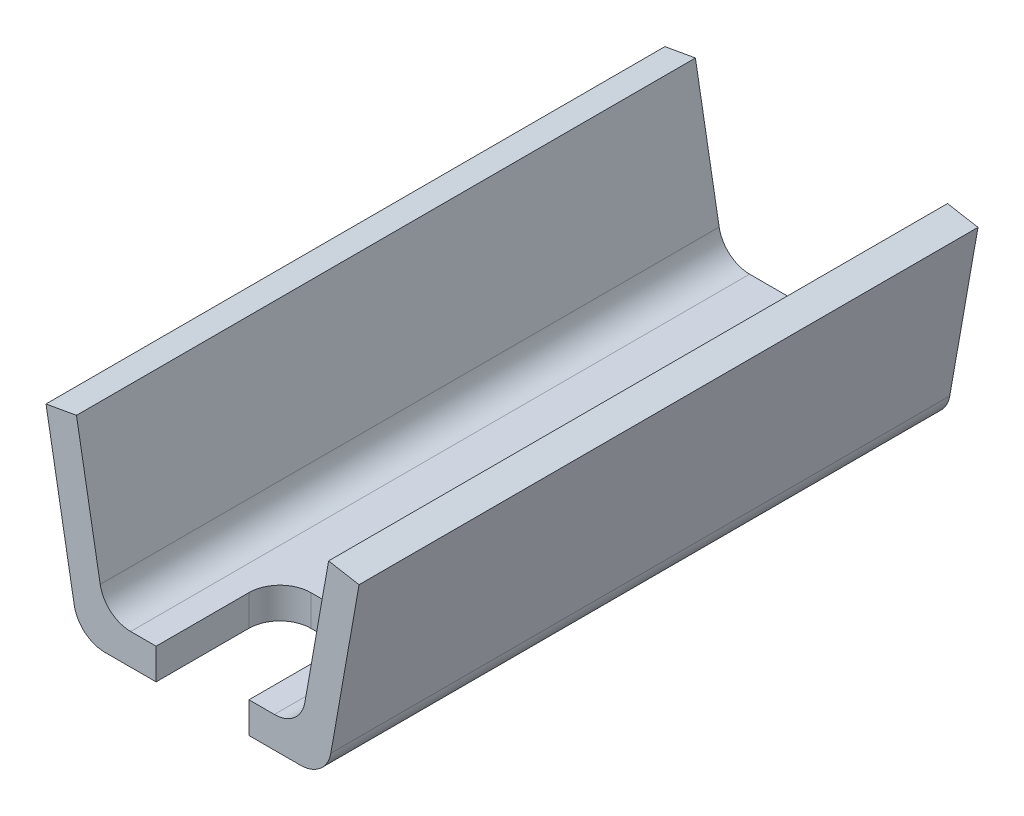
ISO-10303-21;
HEADER;
FILE_DESCRIPTION(('STEP AP214'),'2;1');
FILE_NAME('part.step','',(''),(''),'','','');
FILE_SCHEMA(('AUTOMOTIVE_DESIGN { 1 0 10303 214 1 1 1 1 }'));
ENDSEC;
DATA;
#1=APPLICATION_CONTEXT('core data for automotive mechanical design processes');
#2=APPLICATION_PROTOCOL_DEFINITION('international standard','automotive_design',2000,#1);
#3=PRODUCT_CONTEXT('',#1,'mechanical');
#4=PRODUCT('Part','Part','',(#3));
#5=PRODUCT_RELATED_PRODUCT_CATEGORY('part','',(#4));
#6=PRODUCT_DEFINITION_FORMATION('','',#4);
#7=PRODUCT_DEFINITION_CONTEXT('part definition',#1,'design');
#8=PRODUCT_DEFINITION('design','',#6,#7);
#9=PRODUCT_DEFINITION_SHAPE('','',#8);
#10=(LENGTH_UNIT() NAMED_UNIT(*) SI_UNIT(.MILLI.,.METRE.));
#11=(NAMED_UNIT(*) PLANE_ANGLE_UNIT() SI_UNIT($,.RADIAN.));
#12=(NAMED_UNIT(*) SI_UNIT($,.STERADIAN.) SOLID_ANGLE_UNIT());
#13=UNCERTAINTY_MEASURE_WITH_UNIT(LENGTH_MEASURE(1.E-05),#10,'distance_accuracy_value','');
#14=(GEOMETRIC_REPRESENTATION_CONTEXT(3) GLOBAL_UNCERTAINTY_ASSIGNED_CONTEXT((#13)) GLOBAL_UNIT_ASSIGNED_CONTEXT((#10,
#11,#12)) REPRESENTATION_CONTEXT('',''));
#15=CARTESIAN_POINT('',(0.,0.,0.));
#16=DIRECTION('',(0.,0.,1.));
#17=DIRECTION('',(1.,0.,0.));
#18=AXIS2_PLACEMENT_3D('',#15,#16,#17);
#19=CARTESIAN_POINT('',(11.6090036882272,10.,100.));
#20=DIRECTION('',(0.,0.,1.));
#21=DIRECTION('',(1.,0.,0.));
#22=AXIS2_PLACEMENT_3D('',#19,#20,#21);
#23=PLANE('',#22);
#24=DIRECTION('',(0.,-1.,0.));
#25=VECTOR('',#24,1.);
#26=CARTESIAN_POINT('',(-7.5,10.,100.));
#27=LINE('',#26,#25);
#28=CARTESIAN_POINT('',(-7.5,5.,100.));
#29=VERTEX_POINT('',#28);
#30=CARTESIAN_POINT('',(-7.5,0.,100.));
#31=VERTEX_POINT('',#30);
#32=EDGE_CURVE('E11',#29,#31,#27,.T.);
#33=ORIENTED_EDGE('',*,*,#32,.F.);
#34=DIRECTION('',(-1.,0.,0.));
#35=VECTOR('',#34,1.);
#36=CARTESIAN_POINT('',(11.6090036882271,5.,100.));
#37=LINE('',#36,#35);
#38=CARTESIAN_POINT('',(-11.6090036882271,5.,100.));
#39=VERTEX_POINT('',#38);
#40=EDGE_CURVE('E248',#29,#39,#37,.T.);
#41=ORIENTED_EDGE('',*,*,#40,.T.);
#42=CARTESIAN_POINT('',(-11.6090036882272,9.99999999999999,100.));
#43=DIRECTION('',(0.,0.,-1.));
#44=DIRECTION('',(-1.,0.,0.));
#45=AXIS2_PLACEMENT_3D('',#42,#43,#44);
#46=CIRCLE('',#45,5.);
#47=CARTESIAN_POINT('',(-16.5330424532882,9.13175911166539,100.));
#48=VERTEX_POINT('',#47);
#49=EDGE_CURVE('E247',#39,#48,#46,.T.);
#50=ORIENTED_EDGE('',*,*,#49,.T.);
#51=DIRECTION('',(-0.173648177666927,0.984807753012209,0.));
#52=VECTOR('',#51,1.);
#53=CARTESIAN_POINT('',(-16.5330424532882,9.13175911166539,100.));
#54=LINE('',#53,#52);
#55=CARTESIAN_POINT('',(-20.3657706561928,30.8682408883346,100.));
#56=VERTEX_POINT('',#55);
#57=EDGE_CURVE('E250',#48,#56,#54,.T.);
#58=ORIENTED_EDGE('',*,*,#57,.T.);
#59=DIRECTION('',(-0.984807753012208,-0.173648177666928,0.));
#60=VECTOR('',#59,1.);
#61=CARTESIAN_POINT('',(-25.2898094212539,30.,100.));
#62=LINE('',#61,#60);
#63=CARTESIAN_POINT('',(-25.2898094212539,30.,100.));
#64=VERTEX_POINT('',#63);
#65=EDGE_CURVE('E256',#56,#64,#62,.T.);
#66=ORIENTED_EDGE('',*,*,#65,.T.);
#67=DIRECTION('',(0.173648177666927,-0.984807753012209,0.));
#68=VECTOR('',#67,1.);
#69=CARTESIAN_POINT('',(-20.7285406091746,4.13175911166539,100.));
#70=LINE('',#69,#68);
#71=CARTESIAN_POINT('',(-20.7285406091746,4.13175911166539,100.));
#72=VERTEX_POINT('',#71);
#73=EDGE_CURVE('E258',#64,#72,#70,.T.);
#74=ORIENTED_EDGE('',*,*,#73,.T.);
#75=CARTESIAN_POINT('',(-15.8045018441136,5.,100.));
#76=DIRECTION('',(0.,0.,1.));
#77=DIRECTION('',(-1.,0.,0.));
#78=AXIS2_PLACEMENT_3D('',#75,#76,#77);
#79=CIRCLE('',#78,5.);
#80=CARTESIAN_POINT('',(-15.8045018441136,0.,100.));
#81=VERTEX_POINT('',#80);
#82=EDGE_CURVE('E153',#72,#81,#79,.T.);
#83=ORIENTED_EDGE('',*,*,#82,.T.);
#84=DIRECTION('',(1.,0.,0.));
#85=VECTOR('',#84,1.);
#86=CARTESIAN_POINT('',(-15.8045018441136,0.,100.));
#87=LINE('',#86,#85);
#88=EDGE_CURVE('E152',#81,#31,#87,.T.);
#89=ORIENTED_EDGE('',*,*,#88,.T.);
#90=EDGE_LOOP('',(#33,#41,#50,#58,#66,#74,#83,#89));
#91=FACE_BOUND('',#90,.T.);
#92=ADVANCED_FACE('F39',(#91),#23,.T.);
#93=CARTESIAN_POINT('',(25.2898094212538,30.,100.));
#94=DIRECTION('',(-0.173648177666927,-0.984807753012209,0.));
#95=DIRECTION('',(0.984807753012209,-0.173648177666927,0.));
#96=AXIS2_PLACEMENT_3D('',#93,#94,#95);
#97=PLANE('',#96);
#98=DIRECTION('',(-0.984807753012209,0.173648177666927,0.));
#99=VECTOR('',#98,1.);
#100=CARTESIAN_POINT('',(25.2898094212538,30.,0.));
#101=LINE('',#100,#99);
#102=CARTESIAN_POINT('',(25.2898094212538,30.,0.));
#103=VERTEX_POINT('',#102);
#104=CARTESIAN_POINT('',(20.3657706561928,30.8682408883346,0.));
#105=VERTEX_POINT('',#104);
#106=EDGE_CURVE('E174',#103,#105,#101,.T.);
#107=ORIENTED_EDGE('',*,*,#106,.T.);
#108=DIRECTION('',(0.,0.,-1.));
#109=VECTOR('',#108,1.);
#110=CARTESIAN_POINT('',(20.3657706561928,30.8682408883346,100.));
#111=LINE('',#110,#109);
#112=CARTESIAN_POINT('',(20.3657706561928,30.8682408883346,100.));
#113=VERTEX_POINT('',#112);
#114=EDGE_CURVE('E223',#113,#105,#111,.T.);
#115=ORIENTED_EDGE('',*,*,#114,.F.);
#116=DIRECTION('',(-0.984807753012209,0.173648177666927,0.));
#117=VECTOR('',#116,1.);
#118=CARTESIAN_POINT('',(25.2898094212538,30.,100.));
#119=LINE('',#118,#117);
#120=CARTESIAN_POINT('',(25.2898094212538,30.,100.));
#121=VERTEX_POINT('',#120);
#122=EDGE_CURVE('E198',#121,#113,#119,.T.);
#123=ORIENTED_EDGE('',*,*,#122,.F.);
#124=DIRECTION('',(0.,0.,-1.));
#125=VECTOR('',#124,1.);
#126=CARTESIAN_POINT('',(25.2898094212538,30.,100.));
#127=LINE('',#126,#125);
#128=EDGE_CURVE('E169',#121,#103,#127,.T.);
#129=ORIENTED_EDGE('',*,*,#128,.T.);
#130=EDGE_LOOP('',(#107,#115,#123,#129));
#131=FACE_BOUND('',#130,.T.);
#132=ADVANCED_FACE('F41',(#131),#97,.F.);
#133=CARTESIAN_POINT('',(20.3657706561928,30.8682408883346,100.));
#134=DIRECTION('',(0.984807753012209,-0.173648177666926,0.));
#135=DIRECTION('',(0.173648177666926,0.984807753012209,0.));
#136=AXIS2_PLACEMENT_3D('',#133,#134,#135);
#137=PLANE('',#136);
#138=DIRECTION('',(-0.173648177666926,-0.984807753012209,0.));
#139=VECTOR('',#138,1.);
#140=CARTESIAN_POINT('',(20.3657706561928,30.8682408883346,0.));
#141=LINE('',#140,#139);
#142=CARTESIAN_POINT('',(16.5330424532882,9.13175911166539,0.));
#143=VERTEX_POINT('',#142);
#144=EDGE_CURVE('E177',#105,#143,#141,.T.);
#145=ORIENTED_EDGE('',*,*,#144,.T.);
#146=DIRECTION('',(0.,0.,-1.));
#147=VECTOR('',#146,1.);
#148=CARTESIAN_POINT('',(16.5330424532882,9.13175911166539,100.));
#149=LINE('',#148,#147);
#150=CARTESIAN_POINT('',(16.5330424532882,9.13175911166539,100.));
#151=VERTEX_POINT('',#150);
#152=EDGE_CURVE('E220',#151,#143,#149,.T.);
#153=ORIENTED_EDGE('',*,*,#152,.F.);
#154=DIRECTION('',(-0.173648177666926,-0.984807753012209,0.));
#155=VECTOR('',#154,1.);
#156=CARTESIAN_POINT('',(20.3657706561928,30.8682408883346,100.));
#157=LINE('',#156,#155);
#158=EDGE_CURVE('E117',#113,#151,#157,.T.);
#159=ORIENTED_EDGE('',*,*,#158,.F.);
#160=ORIENTED_EDGE('',*,*,#114,.T.);
#161=EDGE_LOOP('',(#145,#153,#159,#160));
#162=FACE_BOUND('',#161,.T.);
#163=ADVANCED_FACE('F311',(#162),#137,.F.);
#164=CARTESIAN_POINT('',(11.6090036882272,10.,100.));
#165=DIRECTION('',(0.,0.,-1.));
#166=DIRECTION('',(-1.,0.,0.));
#167=AXIS2_PLACEMENT_3D('',#164,#165,#166);
#168=CYLINDRICAL_SURFACE('',#167,5.);
#169=CARTESIAN_POINT('',(11.6090036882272,10.,0.));
#170=DIRECTION('',(0.,0.,-1.));
#171=DIRECTION('',(1.,0.,0.));
#172=AXIS2_PLACEMENT_3D('',#169,#170,#171);
#173=CIRCLE('',#172,5.);
#174=CARTESIAN_POINT('',(11.6090036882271,5.,0.));
#175=VERTEX_POINT('',#174);
#176=EDGE_CURVE('E180',#143,#175,#173,.T.);
#177=ORIENTED_EDGE('',*,*,#176,.T.);
#178=DIRECTION('',(0.,0.,-1.));
#179=VECTOR('',#178,1.);
#180=CARTESIAN_POINT('',(11.6090036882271,5.,100.));
#181=LINE('',#180,#179);
#182=CARTESIAN_POINT('',(11.6090036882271,5.,100.));
#183=VERTEX_POINT('',#182);
#184=EDGE_CURVE('E217',#183,#175,#181,.T.);
#185=ORIENTED_EDGE('',*,*,#184,.F.);
#186=CARTESIAN_POINT('',(11.6090036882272,10.,100.));
#187=DIRECTION('',(0.,0.,-1.));
#188=DIRECTION('',(1.,0.,0.));
#189=AXIS2_PLACEMENT_3D('',#186,#187,#188);
#190=CIRCLE('',#189,5.);
#191=EDGE_CURVE('E245',#151,#183,#190,.T.);
#192=ORIENTED_EDGE('',*,*,#191,.F.);
#193=ORIENTED_EDGE('',*,*,#152,.T.);
#194=EDGE_LOOP('',(#177,#185,#192,#193));
#195=FACE_BOUND('',#194,.T.);
#196=ADVANCED_FACE('F314',(#195),#168,.F.);
#197=CARTESIAN_POINT('',(11.6090036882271,5.,100.));
#198=DIRECTION('',(0.,-1.,0.));
#199=DIRECTION('',(1.,0.,0.));
#200=AXIS2_PLACEMENT_3D('',#197,#198,#199);
#201=PLANE('',#200);
#202=ORIENTED_EDGE('',*,*,#40,.F.);
#203=DIRECTION('',(0.,0.,-1.));
#204=VECTOR('',#203,1.);
#205=CARTESIAN_POINT('',(-7.5,5.,100.));
#206=LINE('',#205,#204);
#207=CARTESIAN_POINT('',(-7.5,5.,85.));
#208=VERTEX_POINT('',#207);
#209=EDGE_CURVE('E241',#29,#208,#206,.T.);
#210=ORIENTED_EDGE('',*,*,#209,.T.);
#211=CARTESIAN_POINT('',(-2.5,5.,85.));
#212=DIRECTION('',(0.,-1.,0.));
#213=DIRECTION('',(1.,0.,0.));
#214=AXIS2_PLACEMENT_3D('',#211,#212,#213);
#215=CIRCLE('',#214,5.);
#216=CARTESIAN_POINT('',(-2.5,5.,80.));
#217=VERTEX_POINT('',#216);
#218=EDGE_CURVE('E303',#208,#217,#215,.T.);
#219=ORIENTED_EDGE('',*,*,#218,.T.);
#220=DIRECTION('',(1.,0.,0.));
#221=VECTOR('',#220,1.);
#222=CARTESIAN_POINT('',(11.6090036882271,5.,80.));
#223=LINE('',#222,#221);
#224=CARTESIAN_POINT('',(2.5,5.,80.));
#225=VERTEX_POINT('',#224);
#226=EDGE_CURVE('E306',#217,#225,#223,.T.);
#227=ORIENTED_EDGE('',*,*,#226,.T.);
#228=CARTESIAN_POINT('',(2.5,5.,85.));
#229=DIRECTION('',(0.,-1.,0.));
#230=DIRECTION('',(1.,0.,0.));
#231=AXIS2_PLACEMENT_3D('',#228,#229,#230);
#232=CIRCLE('',#231,5.);
#233=CARTESIAN_POINT('',(7.5,5.,85.));
#234=VERTEX_POINT('',#233);
#235=EDGE_CURVE('E178',#225,#234,#232,.T.);
#236=ORIENTED_EDGE('',*,*,#235,.T.);
#237=DIRECTION('',(0.,0.,1.));
#238=VECTOR('',#237,1.);
#239=CARTESIAN_POINT('',(7.49999999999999,5.,100.));
#240=LINE('',#239,#238);
#241=CARTESIAN_POINT('',(7.49999999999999,5.,100.));
#242=VERTEX_POINT('',#241);
#243=EDGE_CURVE('E229',#234,#242,#240,.T.);
#244=ORIENTED_EDGE('',*,*,#243,.T.);
#245=EDGE_CURVE('E238',#183,#242,#37,.T.);
#246=ORIENTED_EDGE('',*,*,#245,.F.);
#247=ORIENTED_EDGE('',*,*,#184,.T.);
#248=DIRECTION('',(-1.,0.,0.));
#249=VECTOR('',#248,1.);
#250=CARTESIAN_POINT('',(11.6090036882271,5.,0.));
#251=LINE('',#250,#249);
#252=CARTESIAN_POINT('',(-11.6090036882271,5.,0.));
#253=VERTEX_POINT('',#252);
#254=EDGE_CURVE('E182',#175,#253,#251,.T.);
#255=ORIENTED_EDGE('',*,*,#254,.T.);
#256=DIRECTION('',(0.,0.,-1.));
#257=VECTOR('',#256,1.);
#258=CARTESIAN_POINT('',(-11.6090036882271,5.,100.));
#259=LINE('',#258,#257);
#260=EDGE_CURVE('E214',#39,#253,#259,.T.);
#261=ORIENTED_EDGE('',*,*,#260,.F.);
#262=EDGE_LOOP('',(#202,#210,#219,#227,#236,#244,#246,#247,#255,#261));
#263=FACE_BOUND('',#262,.T.);
#264=ADVANCED_FACE('F237',(#263),#201,.F.);
#265=CARTESIAN_POINT('',(-11.6090036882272,9.99999999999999,100.));
#266=DIRECTION('',(0.,0.,-1.));
#267=DIRECTION('',(-1.,0.,0.));
#268=AXIS2_PLACEMENT_3D('',#265,#266,#267);
#269=CYLINDRICAL_SURFACE('',#268,5.);
#270=CARTESIAN_POINT('',(-11.6090036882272,9.99999999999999,0.));
#271=DIRECTION('',(0.,0.,-1.));
#272=DIRECTION('',(-1.,0.,0.));
#273=AXIS2_PLACEMENT_3D('',#270,#271,#272);
#274=CIRCLE('',#273,5.);
#275=CARTESIAN_POINT('',(-16.5330424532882,9.13175911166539,0.));
#276=VERTEX_POINT('',#275);
#277=EDGE_CURVE('E184',#253,#276,#274,.T.);
#278=ORIENTED_EDGE('',*,*,#277,.T.);
#279=DIRECTION('',(0.,0.,-1.));
#280=VECTOR('',#279,1.);
#281=CARTESIAN_POINT('',(-16.5330424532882,9.13175911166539,100.));
#282=LINE('',#281,#280);
#283=EDGE_CURVE('E211',#48,#276,#282,.T.);
#284=ORIENTED_EDGE('',*,*,#283,.F.);
#285=ORIENTED_EDGE('',*,*,#49,.F.);
#286=ORIENTED_EDGE('',*,*,#260,.T.);
#287=EDGE_LOOP('',(#278,#284,#285,#286));
#288=FACE_BOUND('',#287,.T.);
#289=ADVANCED_FACE('F325',(#288),#269,.F.);
#290=CARTESIAN_POINT('',(-16.5330424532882,9.13175911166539,100.));
#291=DIRECTION('',(-0.984807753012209,-0.173648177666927,0.));
#292=DIRECTION('',(0.173648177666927,-0.984807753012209,0.));
#293=AXIS2_PLACEMENT_3D('',#290,#291,#292);
#294=PLANE('',#293);
#295=DIRECTION('',(-0.173648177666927,0.984807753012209,0.));
#296=VECTOR('',#295,1.);
#297=CARTESIAN_POINT('',(-16.5330424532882,9.13175911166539,0.));
#298=LINE('',#297,#296);
#299=CARTESIAN_POINT('',(-20.3657706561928,30.8682408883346,0.));
#300=VERTEX_POINT('',#299);
#301=EDGE_CURVE('E186',#276,#300,#298,.T.);
#302=ORIENTED_EDGE('',*,*,#301,.T.);
#303=DIRECTION('',(0.,0.,-1.));
#304=VECTOR('',#303,1.);
#305=CARTESIAN_POINT('',(-20.3657706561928,30.8682408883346,100.));
#306=LINE('',#305,#304);
#307=EDGE_CURVE('E208',#56,#300,#306,.T.);
#308=ORIENTED_EDGE('',*,*,#307,.F.);
#309=ORIENTED_EDGE('',*,*,#57,.F.);
#310=ORIENTED_EDGE('',*,*,#283,.T.);
#311=EDGE_LOOP('',(#302,#308,#309,#310));
#312=FACE_BOUND('',#311,.T.);
#313=ADVANCED_FACE('F329',(#312),#294,.F.);
#314=CARTESIAN_POINT('',(-25.2898094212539,30.,100.));
#315=DIRECTION('',(0.173648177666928,-0.984807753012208,0.));
#316=DIRECTION('',(0.984807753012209,0.173648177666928,0.));
#317=AXIS2_PLACEMENT_3D('',#314,#315,#316);
#318=PLANE('',#317);
#319=DIRECTION('',(-0.984807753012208,-0.173648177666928,0.));
#320=VECTOR('',#319,1.);
#321=CARTESIAN_POINT('',(-25.2898094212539,30.,0.));
#322=LINE('',#321,#320);
#323=CARTESIAN_POINT('',(-25.2898094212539,30.,0.));
#324=VERTEX_POINT('',#323);
#325=EDGE_CURVE('E188',#300,#324,#322,.T.);
#326=ORIENTED_EDGE('',*,*,#325,.T.);
#327=DIRECTION('',(0.,0.,-1.));
#328=VECTOR('',#327,1.);
#329=CARTESIAN_POINT('',(-25.2898094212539,30.,100.));
#330=LINE('',#329,#328);
#331=EDGE_CURVE('E205',#64,#324,#330,.T.);
#332=ORIENTED_EDGE('',*,*,#331,.F.);
#333=ORIENTED_EDGE('',*,*,#65,.F.);
#334=ORIENTED_EDGE('',*,*,#307,.T.);
#335=EDGE_LOOP('',(#326,#332,#333,#334));
#336=FACE_BOUND('',#335,.T.);
#337=ADVANCED_FACE('F388',(#336),#318,.F.);
#338=CARTESIAN_POINT('',(-20.7285406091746,4.13175911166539,100.));
#339=DIRECTION('',(0.984807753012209,0.173648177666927,0.));
#340=DIRECTION('',(-0.173648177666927,0.984807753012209,0.));
#341=AXIS2_PLACEMENT_3D('',#338,#339,#340);
#342=PLANE('',#341);
#343=DIRECTION('',(0.173648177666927,-0.984807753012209,0.));
#344=VECTOR('',#343,1.);
#345=CARTESIAN_POINT('',(-20.7285406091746,4.13175911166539,0.));
#346=LINE('',#345,#344);
#347=CARTESIAN_POINT('',(-20.7285406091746,4.13175911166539,0.));
#348=VERTEX_POINT('',#347);
#349=EDGE_CURVE('E190',#324,#348,#346,.T.);
#350=ORIENTED_EDGE('',*,*,#349,.T.);
#351=DIRECTION('',(0.,0.,-1.));
#352=VECTOR('',#351,1.);
#353=CARTESIAN_POINT('',(-20.7285406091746,4.13175911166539,100.));
#354=LINE('',#353,#352);
#355=EDGE_CURVE('E202',#72,#348,#354,.T.);
#356=ORIENTED_EDGE('',*,*,#355,.F.);
#357=ORIENTED_EDGE('',*,*,#73,.F.);
#358=ORIENTED_EDGE('',*,*,#331,.T.);
#359=EDGE_LOOP('',(#350,#356,#357,#358));
#360=FACE_BOUND('',#359,.T.);
#361=ADVANCED_FACE('F385',(#360),#342,.F.);
#362=CARTESIAN_POINT('',(-15.8045018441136,5.,100.));
#363=DIRECTION('',(0.,0.,-1.));
#364=DIRECTION('',(-1.,0.,0.));
#365=AXIS2_PLACEMENT_3D('',#362,#363,#364);
#366=CYLINDRICAL_SURFACE('',#365,5.);
#367=CARTESIAN_POINT('',(-15.8045018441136,5.,0.));
#368=DIRECTION('',(0.,0.,1.));
#369=DIRECTION('',(-1.,0.,0.));
#370=AXIS2_PLACEMENT_3D('',#367,#368,#369);
#371=CIRCLE('',#370,5.);
#372=CARTESIAN_POINT('',(-15.8045018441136,0.,0.));
#373=VERTEX_POINT('',#372);
#374=EDGE_CURVE('E192',#348,#373,#371,.T.);
#375=ORIENTED_EDGE('',*,*,#374,.T.);
#376=DIRECTION('',(0.,0.,-1.));
#377=VECTOR('',#376,1.);
#378=CARTESIAN_POINT('',(-15.8045018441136,0.,100.));
#379=LINE('',#378,#377);
#380=EDGE_CURVE('E164',#81,#373,#379,.T.);
#381=ORIENTED_EDGE('',*,*,#380,.F.);
#382=ORIENTED_EDGE('',*,*,#82,.F.);
#383=ORIENTED_EDGE('',*,*,#355,.T.);
#384=EDGE_LOOP('',(#375,#381,#382,#383));
#385=FACE_BOUND('',#384,.T.);
#386=ADVANCED_FACE('F268',(#385),#366,.T.);
#387=CARTESIAN_POINT('',(-15.8045018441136,0.,100.));
#388=DIRECTION('',(0.,1.,0.));
#389=DIRECTION('',(0.,0.,1.));
#390=AXIS2_PLACEMENT_3D('',#387,#388,#389);
#391=PLANE('',#390);
#392=CARTESIAN_POINT('',(-2.5,0.,85.));
#393=DIRECTION('',(0.,-1.,0.));
#394=DIRECTION('',(0.,0.,1.));
#395=AXIS2_PLACEMENT_3D('',#392,#393,#394);
#396=CIRCLE('',#395,5.);
#397=CARTESIAN_POINT('',(-7.5,0.,85.));
#398=VERTEX_POINT('',#397);
#399=CARTESIAN_POINT('',(-2.5,0.,80.));
#400=VERTEX_POINT('',#399);
#401=EDGE_CURVE('E276',#398,#400,#396,.T.);
#402=ORIENTED_EDGE('',*,*,#401,.F.);
#403=DIRECTION('',(0.,0.,-1.));
#404=VECTOR('',#403,1.);
#405=CARTESIAN_POINT('',(-7.5,0.,85.));
#406=LINE('',#405,#404);
#407=EDGE_CURVE('E272',#31,#398,#406,.T.);
#408=ORIENTED_EDGE('',*,*,#407,.F.);
#409=ORIENTED_EDGE('',*,*,#88,.F.);
#410=ORIENTED_EDGE('',*,*,#380,.T.);
#411=DIRECTION('',(1.,0.,0.));
#412=VECTOR('',#411,1.);
#413=CARTESIAN_POINT('',(-15.8045018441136,0.,0.));
#414=LINE('',#413,#412);
#415=CARTESIAN_POINT('',(15.8045018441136,0.,0.));
#416=VERTEX_POINT('',#415);
#417=EDGE_CURVE('E161',#373,#416,#414,.T.);
#418=ORIENTED_EDGE('',*,*,#417,.T.);
#419=DIRECTION('',(0.,0.,-1.));
#420=VECTOR('',#419,1.);
#421=CARTESIAN_POINT('',(15.8045018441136,0.,100.));
#422=LINE('',#421,#420);
#423=CARTESIAN_POINT('',(15.8045018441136,0.,100.));
#424=VERTEX_POINT('',#423);
#425=EDGE_CURVE('E156',#424,#416,#422,.T.);
#426=ORIENTED_EDGE('',*,*,#425,.F.);
#427=CARTESIAN_POINT('',(7.5,0.,100.));
#428=VERTEX_POINT('',#427);
#429=EDGE_CURVE('E144',#428,#424,#87,.T.);
#430=ORIENTED_EDGE('',*,*,#429,.F.);
#431=DIRECTION('',(0.,0.,1.));
#432=VECTOR('',#431,1.);
#433=CARTESIAN_POINT('',(7.49999999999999,0.,100.));
#434=LINE('',#433,#432);
#435=CARTESIAN_POINT('',(7.5,0.,85.));
#436=VERTEX_POINT('',#435);
#437=EDGE_CURVE('E54',#436,#428,#434,.T.);
#438=ORIENTED_EDGE('',*,*,#437,.F.);
#439=CARTESIAN_POINT('',(2.5,0.,85.));
#440=DIRECTION('',(0.,-1.,0.));
#441=DIRECTION('',(0.,0.,1.));
#442=AXIS2_PLACEMENT_3D('',#439,#440,#441);
#443=CIRCLE('',#442,5.);
#444=CARTESIAN_POINT('',(2.5,0.,80.));
#445=VERTEX_POINT('',#444);
#446=EDGE_CURVE('E287',#445,#436,#443,.T.);
#447=ORIENTED_EDGE('',*,*,#446,.F.);
#448=DIRECTION('',(1.,0.,0.));
#449=VECTOR('',#448,1.);
#450=CARTESIAN_POINT('',(2.5,0.,80.));
#451=LINE('',#450,#449);
#452=EDGE_CURVE('E282',#400,#445,#451,.T.);
#453=ORIENTED_EDGE('',*,*,#452,.F.);
#454=EDGE_LOOP('',(#402,#408,#409,#410,#418,#426,#430,#438,#447,#453));
#455=FACE_BOUND('',#454,.T.);
#456=ADVANCED_FACE('F158',(#455),#391,.F.);
#457=CARTESIAN_POINT('',(15.8045018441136,5.,100.));
#458=DIRECTION('',(0.,0.,-1.));
#459=DIRECTION('',(-1.,0.,0.));
#460=AXIS2_PLACEMENT_3D('',#457,#458,#459);
#461=CYLINDRICAL_SURFACE('',#460,5.);
#462=CARTESIAN_POINT('',(15.8045018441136,5.,0.));
#463=DIRECTION('',(0.,0.,1.));
#464=DIRECTION('',(1.,0.,0.));
#465=AXIS2_PLACEMENT_3D('',#462,#463,#464);
#466=CIRCLE('',#465,5.);
#467=CARTESIAN_POINT('',(20.7285406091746,4.1317591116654,0.));
#468=VERTEX_POINT('',#467);
#469=EDGE_CURVE('E195',#416,#468,#466,.T.);
#470=ORIENTED_EDGE('',*,*,#469,.T.);
#471=DIRECTION('',(0.,0.,-1.));
#472=VECTOR('',#471,1.);
#473=CARTESIAN_POINT('',(20.7285406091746,4.1317591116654,100.));
#474=LINE('',#473,#472);
#475=CARTESIAN_POINT('',(20.7285406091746,4.1317591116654,100.));
#476=VERTEX_POINT('',#475);
#477=EDGE_CURVE('E165',#476,#468,#474,.T.);
#478=ORIENTED_EDGE('',*,*,#477,.F.);
#479=CARTESIAN_POINT('',(15.8045018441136,5.,100.));
#480=DIRECTION('',(0.,0.,1.));
#481=DIRECTION('',(1.,0.,0.));
#482=AXIS2_PLACEMENT_3D('',#479,#480,#481);
#483=CIRCLE('',#482,5.);
#484=EDGE_CURVE('E148',#424,#476,#483,.T.);
#485=ORIENTED_EDGE('',*,*,#484,.F.);
#486=ORIENTED_EDGE('',*,*,#425,.T.);
#487=EDGE_LOOP('',(#470,#478,#485,#486));
#488=FACE_BOUND('',#487,.T.);
#489=ADVANCED_FACE('F167',(#488),#461,.T.);
#490=CARTESIAN_POINT('',(20.7285406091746,4.1317591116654,100.));
#491=DIRECTION('',(-0.984807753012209,0.173648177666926,0.));
#492=DIRECTION('',(-0.173648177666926,-0.984807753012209,0.));
#493=AXIS2_PLACEMENT_3D('',#490,#491,#492);
#494=PLANE('',#493);
#495=DIRECTION('',(0.173648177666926,0.984807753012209,0.));
#496=VECTOR('',#495,1.);
#497=CARTESIAN_POINT('',(20.7285406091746,4.1317591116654,0.));
#498=LINE('',#497,#496);
#499=EDGE_CURVE('E108',#468,#103,#498,.T.);
#500=ORIENTED_EDGE('',*,*,#499,.T.);
#501=ORIENTED_EDGE('',*,*,#128,.F.);
#502=DIRECTION('',(0.173648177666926,0.984807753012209,0.));
#503=VECTOR('',#502,1.);
#504=CARTESIAN_POINT('',(20.7285406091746,4.1317591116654,100.));
#505=LINE('',#504,#503);
#506=EDGE_CURVE('E63',#476,#121,#505,.T.);
#507=ORIENTED_EDGE('',*,*,#506,.F.);
#508=ORIENTED_EDGE('',*,*,#477,.T.);
#509=EDGE_LOOP('',(#500,#501,#507,#508));
#510=FACE_BOUND('',#509,.T.);
#511=ADVANCED_FACE('F370',(#510),#494,.F.);
#512=DIRECTION('',(0.,1.,0.));
#513=VECTOR('',#512,1.);
#514=CARTESIAN_POINT('',(7.49999999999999,10.,100.));
#515=LINE('',#514,#513);
#516=EDGE_CURVE('E47',#428,#242,#515,.T.);
#517=ORIENTED_EDGE('',*,*,#516,.F.);
#518=ORIENTED_EDGE('',*,*,#429,.T.);
#519=ORIENTED_EDGE('',*,*,#484,.T.);
#520=ORIENTED_EDGE('',*,*,#506,.T.);
#521=ORIENTED_EDGE('',*,*,#122,.T.);
#522=ORIENTED_EDGE('',*,*,#158,.T.);
#523=ORIENTED_EDGE('',*,*,#191,.T.);
#524=ORIENTED_EDGE('',*,*,#245,.T.);
#525=EDGE_LOOP('',(#517,#518,#519,#520,#521,#522,#523,#524));
#526=FACE_BOUND('',#525,.T.);
#527=ADVANCED_FACE('F146',(#526),#23,.T.);
#528=CARTESIAN_POINT('',(11.6090036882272,10.,0.));
#529=DIRECTION('',(0.,0.,1.));
#530=DIRECTION('',(1.,0.,0.));
#531=AXIS2_PLACEMENT_3D('',#528,#529,#530);
#532=PLANE('',#531);
#533=ORIENTED_EDGE('',*,*,#106,.F.);
#534=ORIENTED_EDGE('',*,*,#499,.F.);
#535=ORIENTED_EDGE('',*,*,#469,.F.);
#536=ORIENTED_EDGE('',*,*,#417,.F.);
#537=ORIENTED_EDGE('',*,*,#374,.F.);
#538=ORIENTED_EDGE('',*,*,#349,.F.);
#539=ORIENTED_EDGE('',*,*,#325,.F.);
#540=ORIENTED_EDGE('',*,*,#301,.F.);
#541=ORIENTED_EDGE('',*,*,#277,.F.);
#542=ORIENTED_EDGE('',*,*,#254,.F.);
#543=ORIENTED_EDGE('',*,*,#176,.F.);
#544=ORIENTED_EDGE('',*,*,#144,.F.);
#545=EDGE_LOOP('',(#533,#534,#535,#536,#537,#538,#539,#540,#541,#542,#543,#544));
#546=FACE_BOUND('',#545,.T.);
#547=ADVANCED_FACE('F320',(#546),#532,.F.);
#548=CARTESIAN_POINT('',(2.5,30.8682408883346,85.));
#549=DIRECTION('',(0.,-1.,0.));
#550=DIRECTION('',(0.,0.,-1.));
#551=AXIS2_PLACEMENT_3D('',#548,#549,#550);
#552=CYLINDRICAL_SURFACE('',#551,5.);
#553=DIRECTION('',(0.,-1.,0.));
#554=VECTOR('',#553,1.);
#555=CARTESIAN_POINT('',(2.5,30.8682408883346,80.));
#556=LINE('',#555,#554);
#557=EDGE_CURVE('E293',#225,#445,#556,.T.);
#558=ORIENTED_EDGE('',*,*,#557,.T.);
#559=ORIENTED_EDGE('',*,*,#446,.T.);
#560=DIRECTION('',(0.,-1.,0.));
#561=VECTOR('',#560,1.);
#562=CARTESIAN_POINT('',(7.5,30.8682408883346,85.));
#563=LINE('',#562,#561);
#564=EDGE_CURVE('E242',#234,#436,#563,.T.);
#565=ORIENTED_EDGE('',*,*,#564,.F.);
#566=ORIENTED_EDGE('',*,*,#235,.F.);
#567=EDGE_LOOP('',(#558,#559,#565,#566));
#568=FACE_BOUND('',#567,.T.);
#569=ADVANCED_FACE('F345',(#568),#552,.F.);
#570=CARTESIAN_POINT('',(2.5,30.8682408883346,80.));
#571=DIRECTION('',(0.,0.,-1.));
#572=DIRECTION('',(-1.,0.,0.));
#573=AXIS2_PLACEMENT_3D('',#570,#571,#572);
#574=PLANE('',#573);
#575=DIRECTION('',(0.,-1.,0.));
#576=VECTOR('',#575,1.);
#577=CARTESIAN_POINT('',(-2.5,30.8682408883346,80.));
#578=LINE('',#577,#576);
#579=EDGE_CURVE('E296',#217,#400,#578,.T.);
#580=ORIENTED_EDGE('',*,*,#579,.T.);
#581=ORIENTED_EDGE('',*,*,#452,.T.);
#582=ORIENTED_EDGE('',*,*,#557,.F.);
#583=ORIENTED_EDGE('',*,*,#226,.F.);
#584=EDGE_LOOP('',(#580,#581,#582,#583));
#585=FACE_BOUND('',#584,.T.);
#586=ADVANCED_FACE('F347',(#585),#574,.F.);
#587=CARTESIAN_POINT('',(-2.5,30.8682408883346,85.));
#588=DIRECTION('',(0.,-1.,0.));
#589=DIRECTION('',(0.,0.,-1.));
#590=AXIS2_PLACEMENT_3D('',#587,#588,#589);
#591=CYLINDRICAL_SURFACE('',#590,5.);
#592=DIRECTION('',(0.,-1.,0.));
#593=VECTOR('',#592,1.);
#594=CARTESIAN_POINT('',(-7.5,30.8682408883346,85.));
#595=LINE('',#594,#593);
#596=EDGE_CURVE('E291',#208,#398,#595,.T.);
#597=ORIENTED_EDGE('',*,*,#596,.T.);
#598=ORIENTED_EDGE('',*,*,#401,.T.);
#599=ORIENTED_EDGE('',*,*,#579,.F.);
#600=ORIENTED_EDGE('',*,*,#218,.F.);
#601=EDGE_LOOP('',(#597,#598,#599,#600));
#602=FACE_BOUND('',#601,.T.);
#603=ADVANCED_FACE('F350',(#602),#591,.F.);
#604=CARTESIAN_POINT('',(-7.5,30.8682408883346,85.));
#605=DIRECTION('',(-1.,0.,0.));
#606=DIRECTION('',(0.,0.,1.));
#607=AXIS2_PLACEMENT_3D('',#604,#605,#606);
#608=PLANE('',#607);
#609=ORIENTED_EDGE('',*,*,#32,.T.);
#610=ORIENTED_EDGE('',*,*,#407,.T.);
#611=ORIENTED_EDGE('',*,*,#596,.F.);
#612=ORIENTED_EDGE('',*,*,#209,.F.);
#613=EDGE_LOOP('',(#609,#610,#611,#612));
#614=FACE_BOUND('',#613,.T.);
#615=ADVANCED_FACE('F351',(#614),#608,.F.);
#616=CARTESIAN_POINT('',(7.49999999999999,30.8682408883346,100.));
#617=DIRECTION('',(1.,0.,0.));
#618=DIRECTION('',(0.,0.,-1.));
#619=AXIS2_PLACEMENT_3D('',#616,#617,#618);
#620=PLANE('',#619);
#621=ORIENTED_EDGE('',*,*,#564,.T.);
#622=ORIENTED_EDGE('',*,*,#437,.T.);
#623=ORIENTED_EDGE('',*,*,#516,.T.);
#624=ORIENTED_EDGE('',*,*,#243,.F.);
#625=EDGE_LOOP('',(#621,#622,#623,#624));
#626=FACE_BOUND('',#625,.T.);
#627=ADVANCED_FACE('F227',(#626),#620,.F.);
#628=CLOSED_SHELL('',(#92,#132,#163,#196,#264,#289,#313,#337,#361,#386,#456,#489,#511,#527,#547,
#569,#586,#603,#615,#627));
#629=MANIFOLD_SOLID_BREP('B2',#628);
#630=ADVANCED_BREP_SHAPE_REPRESENTATION('',(#18,#629),#14);
#631=SHAPE_DEFINITION_REPRESENTATION(#9,#630);
ENDSEC;
END-ISO-10303-21;
